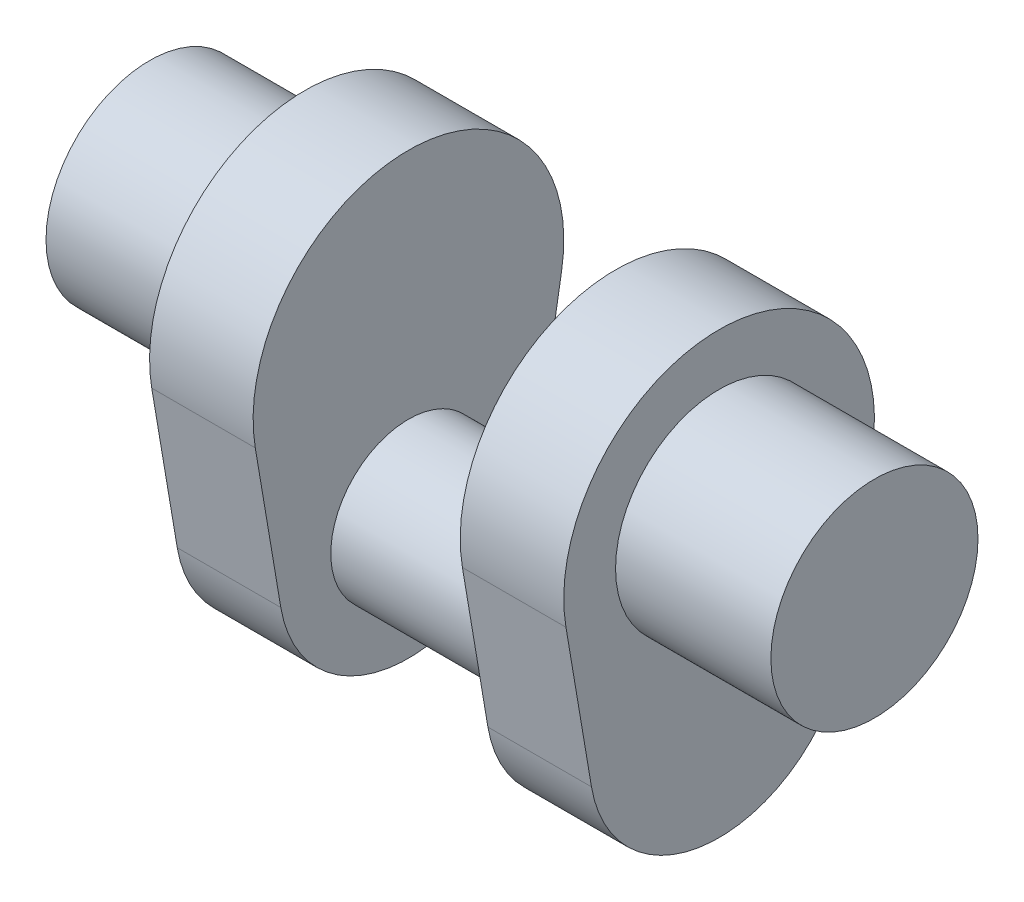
from build123d import *

# Parameters (mm, degrees)
SKETCH1_R           = 15
BOSS_EXTRUDE1_DEPTH = 20
BOSS_EXTRUDE2_DEPTH = 20
SKETCH3_R           = 20
BOSS_EXTRUDE3_DEPTH = 30


with BuildPart() as part:
    # Sketch1 → Boss-Extrude1 (new, symmetric)
    with BuildSketch(Plane(origin=(0, 0, 0), x_dir=(0, 0, -1), z_dir=(1, 0, 0))):
        Circle(SKETCH1_R)
    extrude(amount=BOSS_EXTRUDE1_DEPTH, both=True)

    # Sketch2 → Boss-Extrude2 (add)
    with BuildSketch(Plane(origin=(20, 0, 0), x_dir=(0, 0, -1), z_dir=(1, 0, 0))):
        with BuildLine():
            Line((-29.580398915, 25), (-24.65033243, -4.166666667))
            ThreePointArc((-24.65033243, -4.166666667), (0, -25), (24.65033243, -4.166666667))
            Line((24.65033243, -4.166666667), (29.580398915, 25))
            ThreePointArc((29.580398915, 25), (0, 60), (-29.580398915, 25))
        make_face()
    boss_extrude2 = extrude(amount=BOSS_EXTRUDE2_DEPTH)

    # Mirror1: Boss-Extrude2 across plane
    add(boss_extrude2.mirror(Plane(origin=(0, 0, 0), x_dir=(0, 0, 1), z_dir=(1, 0, 0))))

    # Sketch3 → Boss-Extrude3 (add)
    with BuildSketch(Plane(origin=(40, 0, 0), x_dir=(0, 0, -1), z_dir=(1, 0, 0))):
        with Locations((0, 30)):
            Circle(SKETCH3_R)
    boss_extrude3 = extrude(amount=BOSS_EXTRUDE3_DEPTH)

    # Mirror2: Boss-Extrude3 across plane
    add(boss_extrude3.mirror(Plane(origin=(0, 0, 0), x_dir=(0, 0, 1), z_dir=(1, 0, 0))))


solid = part.part
